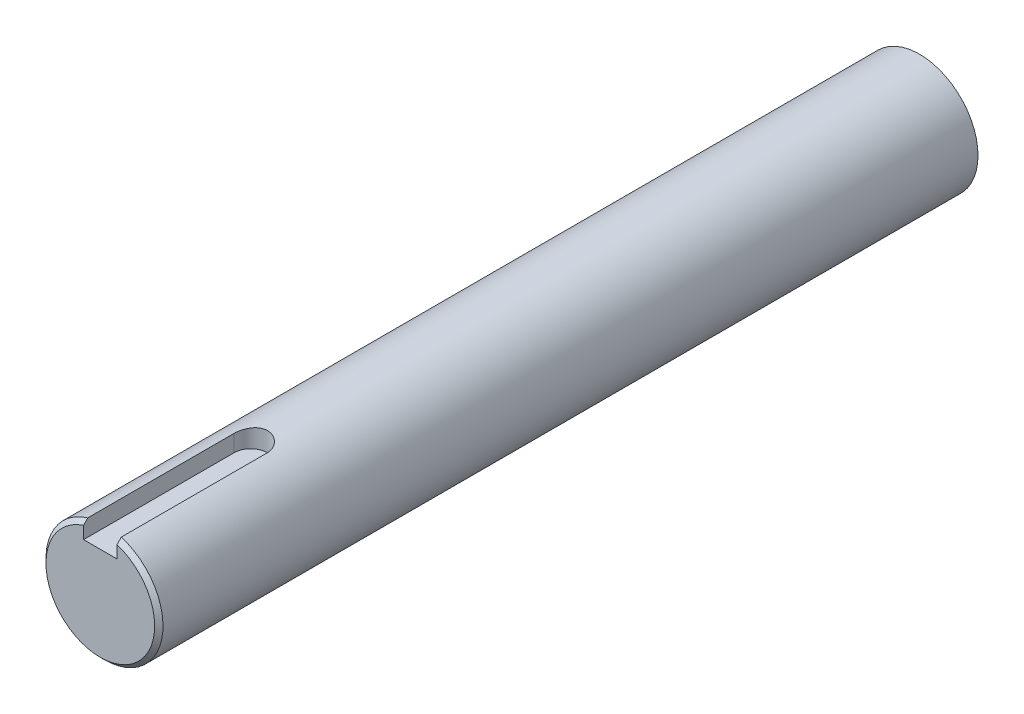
ISO-10303-21;
HEADER;
FILE_DESCRIPTION(('STEP AP214'),'2;1');
FILE_NAME('part.step','',(''),(''),'','','');
FILE_SCHEMA(('AUTOMOTIVE_DESIGN { 1 0 10303 214 1 1 1 1 }'));
ENDSEC;
DATA;
#1=APPLICATION_CONTEXT('core data for automotive mechanical design processes');
#2=APPLICATION_PROTOCOL_DEFINITION('international standard','automotive_design',2000,#1);
#3=PRODUCT_CONTEXT('',#1,'mechanical');
#4=PRODUCT('Part','Part','',(#3));
#5=PRODUCT_RELATED_PRODUCT_CATEGORY('part','',(#4));
#6=PRODUCT_DEFINITION_FORMATION('','',#4);
#7=PRODUCT_DEFINITION_CONTEXT('part definition',#1,'design');
#8=PRODUCT_DEFINITION('design','',#6,#7);
#9=PRODUCT_DEFINITION_SHAPE('','',#8);
#10=(LENGTH_UNIT() NAMED_UNIT(*) SI_UNIT(.MILLI.,.METRE.));
#11=(NAMED_UNIT(*) PLANE_ANGLE_UNIT() SI_UNIT($,.RADIAN.));
#12=(NAMED_UNIT(*) SI_UNIT($,.STERADIAN.) SOLID_ANGLE_UNIT());
#13=UNCERTAINTY_MEASURE_WITH_UNIT(LENGTH_MEASURE(1.E-05),#10,'distance_accuracy_value','');
#14=(GEOMETRIC_REPRESENTATION_CONTEXT(3) GLOBAL_UNCERTAINTY_ASSIGNED_CONTEXT((#13)) GLOBAL_UNIT_ASSIGNED_CONTEXT((#10,
#11,#12)) REPRESENTATION_CONTEXT('',''));
#15=CARTESIAN_POINT('',(0.,0.,0.));
#16=DIRECTION('',(0.,0.,1.));
#17=DIRECTION('',(1.,0.,0.));
#18=AXIS2_PLACEMENT_3D('',#15,#16,#17);
#19=CARTESIAN_POINT('',(0.,0.,98.));
#20=DIRECTION('',(0.,0.,-1.));
#21=DIRECTION('',(-1.,0.,0.));
#22=AXIS2_PLACEMENT_3D('',#19,#20,#21);
#23=CYLINDRICAL_SURFACE('',#22,7.);
#24=CARTESIAN_POINT('',(0.,0.,0.));
#25=DIRECTION('',(0.,0.,1.));
#26=DIRECTION('',(1.,0.,0.));
#27=AXIS2_PLACEMENT_3D('',#24,#25,#26);
#28=CIRCLE('',#27,7.);
#29=CARTESIAN_POINT('',(7.,0.,0.));
#30=VERTEX_POINT('',#29);
#31=EDGE_CURVE('E103',#30,#30,#28,.T.);
#32=ORIENTED_EDGE('',*,*,#31,.T.);
#33=EDGE_LOOP('',(#32));
#34=FACE_BOUND('',#33,.T.);
#35=DIRECTION('',(0.,0.,-1.));
#36=VECTOR('',#35,1.);
#37=CARTESIAN_POINT('',(2.,6.70820393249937,98.));
#38=LINE('',#37,#36);
#39=CARTESIAN_POINT('',(2.,6.70820393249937,97.5));
#40=VERTEX_POINT('',#39);
#41=CARTESIAN_POINT('',(2.,6.70820393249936,80.));
#42=VERTEX_POINT('',#41);
#43=EDGE_CURVE('E102',#40,#42,#38,.T.);
#44=ORIENTED_EDGE('',*,*,#43,.F.);
#45=CARTESIAN_POINT('',(0.,0.,97.5));
#46=DIRECTION('',(0.,0.,1.));
#47=DIRECTION('',(1.,0.,0.));
#48=AXIS2_PLACEMENT_3D('',#45,#46,#47);
#49=CIRCLE('',#48,7.);
#50=CARTESIAN_POINT('',(-2.,6.70820393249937,97.5));
#51=VERTEX_POINT('',#50);
#52=EDGE_CURVE('E48',#40,#51,#49,.F.);
#53=ORIENTED_EDGE('',*,*,#52,.T.);
#54=DIRECTION('',(0.,0.,-1.));
#55=VECTOR('',#54,1.);
#56=CARTESIAN_POINT('',(-2.,6.70820393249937,98.));
#57=LINE('',#56,#55);
#58=CARTESIAN_POINT('',(-2.,6.70820393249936,80.));
#59=VERTEX_POINT('',#58);
#60=EDGE_CURVE('E113',#51,#59,#57,.T.);
#61=ORIENTED_EDGE('',*,*,#60,.T.);
#62=CARTESIAN_POINT('',(2.,6.70820393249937,80.));
#63=CARTESIAN_POINT('',(2.00000099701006,6.70819953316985,79.9449659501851));
#64=CARTESIAN_POINT('',(1.99772698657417,6.70888204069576,79.8899594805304));
#65=CARTESIAN_POINT('',(1.988664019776,6.71157572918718,79.7803637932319));
#66=CARTESIAN_POINT('',(1.98187599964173,6.71358663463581,79.7257744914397));
#67=CARTESIAN_POINT('',(1.95485062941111,6.72152750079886,79.563492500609));
#68=CARTESIAN_POINT('',(1.92795143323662,6.72936619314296,79.4569243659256));
#69=CARTESIAN_POINT('',(1.85729763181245,6.74920530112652,79.2500599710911));
#70=CARTESIAN_POINT('',(1.81354760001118,6.76120458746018,79.1497620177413));
#71=CARTESIAN_POINT('',(1.7105009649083,6.78800504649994,78.9578633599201));
#72=CARTESIAN_POINT('',(1.65119805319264,6.80280735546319,78.8662662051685));
#73=CARTESIAN_POINT('',(1.51692637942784,6.83401742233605,78.6918092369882));
#74=CARTESIAN_POINT('',(1.44159286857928,6.85045675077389,78.6092358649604));
#75=CARTESIAN_POINT('',(1.27817556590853,6.88281888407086,78.4577009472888));
#76=CARTESIAN_POINT('',(1.19008966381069,6.89874160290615,78.3887416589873));
#77=CARTESIAN_POINT('',(1.00164390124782,6.92863365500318,78.2651698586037));
#78=CARTESIAN_POINT('',(0.901086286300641,6.94256116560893,78.210847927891));
#79=CARTESIAN_POINT('',(0.69180361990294,6.96652585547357,78.1199966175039));
#80=CARTESIAN_POINT('',(0.583080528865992,6.9765639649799,78.0834629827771));
#81=CARTESIAN_POINT('',(0.363559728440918,6.99139511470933,78.0301658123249));
#82=CARTESIAN_POINT('',(0.252890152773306,6.9963181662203,78.0129113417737));
#83=CARTESIAN_POINT('',(0.0301224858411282,7.0008209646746,77.9971132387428));
#84=CARTESIAN_POINT('',(-0.0819753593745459,7.00040161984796,77.9985664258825));
#85=CARTESIAN_POINT('',(-0.300980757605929,6.99436005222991,78.0198064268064));
#86=CARTESIAN_POINT('',(-0.40794465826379,6.98888865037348,78.0390618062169));
#87=CARTESIAN_POINT('',(-0.617053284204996,6.97353876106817,78.0944954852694));
#88=CARTESIAN_POINT('',(-0.719197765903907,6.96366005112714,78.1306746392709));
#89=CARTESIAN_POINT('',(-0.917074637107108,6.94039022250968,78.2193097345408));
#90=CARTESIAN_POINT('',(-1.01272458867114,6.92696183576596,78.2719395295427));
#91=CARTESIAN_POINT('',(-1.19400864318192,6.89802743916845,78.3918457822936));
#92=CARTESIAN_POINT('',(-1.27964070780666,6.88252100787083,78.4591252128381));
#93=CARTESIAN_POINT('',(-1.4416242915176,6.85045847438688,78.6091975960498));
#94=CARTESIAN_POINT('',(-1.51754611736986,6.83388462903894,78.6924510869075));
#95=CARTESIAN_POINT('',(-1.65448071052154,6.8020328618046,78.8706972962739));
#96=CARTESIAN_POINT('',(-1.71548924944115,6.78675530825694,78.9656933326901));
#97=CARTESIAN_POINT('',(-1.82126577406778,6.75914312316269,79.165787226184));
#98=CARTESIAN_POINT('',(-1.86589126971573,6.74683461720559,79.2709641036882));
#99=CARTESIAN_POINT('',(-1.93662306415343,6.72687625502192,79.4877120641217));
#100=CARTESIAN_POINT('',(-1.96275743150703,6.71921934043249,79.5992731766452));
#101=CARTESIAN_POINT('',(-1.98612021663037,6.71232934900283,79.7598794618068));
#102=CARTESIAN_POINT('',(-1.99132502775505,6.71078540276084,79.807779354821));
#103=CARTESIAN_POINT('',(-1.99826154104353,6.7087227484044,79.9037782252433));
#104=CARTESIAN_POINT('',(-1.99999854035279,6.70820247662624,79.9518767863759));
#105=CARTESIAN_POINT('',(-2.,6.70820393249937,80.));
#106=B_SPLINE_CURVE_WITH_KNOTS('',3,(#62,#63,#64,#65,#66,#67,#68,#69,#70,#71,#72,#73,#74,#75,
#76,#77,#78,#79,#80,#81,#82,#83,#84,#85,#86,#87,#88,#89,#90,#91,#92,#93,#94,#95,#96,#97,#98,#99,
#100,#101,#102,#103,#104,#105),.UNSPECIFIED.,.F.,.F.,(4,2,2,2,2,2,2,2,2,2,2,2,2,2,2,2,2,2,2,2,2,
4),(0.,0.164996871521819,0.32995953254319,0.658815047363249,0.987581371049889,1.3164812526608,
1.65386790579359,1.99131045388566,2.33502692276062,2.67866113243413,3.01332990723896,
3.34794178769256,3.67287650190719,3.99782762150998,4.32633613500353,4.65491137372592,
4.99498620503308,5.33515734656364,5.67822068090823,6.0207621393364,6.16526974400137,
6.30955644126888),.UNSPECIFIED.);
#107=EDGE_CURVE('E97',#42,#59,#106,.T.);
#108=ORIENTED_EDGE('',*,*,#107,.F.);
#109=EDGE_LOOP('',(#44,#53,#61,#108));
#110=FACE_BOUND('',#109,.T.);
#111=ADVANCED_FACE('F35',(#34,#110),#23,.T.);
#112=CARTESIAN_POINT('',(2.,4.7,98.));
#113=DIRECTION('',(1.,0.,0.));
#114=DIRECTION('',(0.,1.,0.));
#115=AXIS2_PLACEMENT_3D('',#112,#113,#114);
#116=PLANE('',#115);
#117=DIRECTION('',(0.,-1.,0.));
#118=VECTOR('',#117,1.);
#119=CARTESIAN_POINT('',(2.,4.7,98.));
#120=LINE('',#119,#118);
#121=CARTESIAN_POINT('',(2.,6.18465843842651,98.));
#122=VERTEX_POINT('',#121);
#123=CARTESIAN_POINT('',(2.,4.7,98.));
#124=VERTEX_POINT('',#123);
#125=EDGE_CURVE('E161',#122,#124,#120,.T.);
#126=ORIENTED_EDGE('',*,*,#125,.F.);
#127=CARTESIAN_POINT('',(2.,6.18465843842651,98.));
#128=CARTESIAN_POINT('',(2.,6.27206463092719,97.9168222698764));
#129=CARTESIAN_POINT('',(2.,6.35939651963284,97.8335667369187));
#130=CARTESIAN_POINT('',(2.,6.53391168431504,97.6669000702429));
#131=CARTESIAN_POINT('',(2.,6.62109496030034,97.583488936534));
#132=CARTESIAN_POINT('',(2.,6.70820393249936,97.5));
#133=B_SPLINE_CURVE_WITH_KNOTS('',3,(#127,#128,#129,#130,#131,#132),.UNSPECIFIED.,.F.,.F.,(4,2,
4),(0.,0.361973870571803,0.723947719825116),.UNSPECIFIED.);
#134=EDGE_CURVE('E62',#122,#40,#133,.T.);
#135=ORIENTED_EDGE('',*,*,#134,.T.);
#136=ORIENTED_EDGE('',*,*,#43,.T.);
#137=DIRECTION('',(0.,1.,0.));
#138=VECTOR('',#137,1.);
#139=CARTESIAN_POINT('',(2.,4.7,80.));
#140=LINE('',#139,#138);
#141=CARTESIAN_POINT('',(2.,4.7,80.));
#142=VERTEX_POINT('',#141);
#143=EDGE_CURVE('E89',#142,#42,#140,.T.);
#144=ORIENTED_EDGE('',*,*,#143,.F.);
#145=DIRECTION('',(0.,0.,-1.));
#146=VECTOR('',#145,1.);
#147=CARTESIAN_POINT('',(2.,4.7,98.));
#148=LINE('',#147,#146);
#149=EDGE_CURVE('E101',#124,#142,#148,.T.);
#150=ORIENTED_EDGE('',*,*,#149,.F.);
#151=EDGE_LOOP('',(#126,#135,#136,#144,#150));
#152=FACE_BOUND('',#151,.T.);
#153=ADVANCED_FACE('F100',(#152),#116,.F.);
#154=CARTESIAN_POINT('',(2.,4.7,98.));
#155=DIRECTION('',(0.,-1.,0.));
#156=DIRECTION('',(1.,0.,0.));
#157=AXIS2_PLACEMENT_3D('',#154,#155,#156);
#158=PLANE('',#157);
#159=ORIENTED_EDGE('',*,*,#149,.T.);
#160=CARTESIAN_POINT('',(0.,4.7,80.));
#161=DIRECTION('',(0.,1.,0.));
#162=DIRECTION('',(-1.,0.,0.));
#163=AXIS2_PLACEMENT_3D('',#160,#161,#162);
#164=CIRCLE('',#163,2.);
#165=CARTESIAN_POINT('',(-2.,4.7,80.));
#166=VERTEX_POINT('',#165);
#167=EDGE_CURVE('E85',#142,#166,#164,.T.);
#168=ORIENTED_EDGE('',*,*,#167,.T.);
#169=DIRECTION('',(0.,0.,-1.));
#170=VECTOR('',#169,1.);
#171=CARTESIAN_POINT('',(-2.,4.7,98.));
#172=LINE('',#171,#170);
#173=CARTESIAN_POINT('',(-2.,4.7,98.));
#174=VERTEX_POINT('',#173);
#175=EDGE_CURVE('E109',#174,#166,#172,.T.);
#176=ORIENTED_EDGE('',*,*,#175,.F.);
#177=DIRECTION('',(-1.,0.,0.));
#178=VECTOR('',#177,1.);
#179=CARTESIAN_POINT('',(2.,4.7,98.));
#180=LINE('',#179,#178);
#181=EDGE_CURVE('E107',#124,#174,#180,.T.);
#182=ORIENTED_EDGE('',*,*,#181,.F.);
#183=EDGE_LOOP('',(#159,#168,#176,#182));
#184=FACE_BOUND('',#183,.T.);
#185=ADVANCED_FACE('F106',(#184),#158,.F.);
#186=CARTESIAN_POINT('',(-2.,4.7,98.));
#187=DIRECTION('',(-1.,0.,0.));
#188=DIRECTION('',(0.,0.,1.));
#189=AXIS2_PLACEMENT_3D('',#186,#187,#188);
#190=PLANE('',#189);
#191=ORIENTED_EDGE('',*,*,#60,.F.);
#192=CARTESIAN_POINT('',(-2.,6.70820393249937,97.5));
#193=CARTESIAN_POINT('',(-2.,6.62109496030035,97.583488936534));
#194=CARTESIAN_POINT('',(-2.,6.53391168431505,97.6669000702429));
#195=CARTESIAN_POINT('',(-2.,6.35939651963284,97.8335667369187));
#196=CARTESIAN_POINT('',(-2.,6.27206463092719,97.9168222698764));
#197=CARTESIAN_POINT('',(-2.,6.18465843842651,98.));
#198=B_SPLINE_CURVE_WITH_KNOTS('',3,(#192,#193,#194,#195,#196,#197),.UNSPECIFIED.,.F.,.F.,(4,2,
4),(0.,0.361973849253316,0.723947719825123),.UNSPECIFIED.);
#199=CARTESIAN_POINT('',(-2.,6.18465843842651,98.));
#200=VERTEX_POINT('',#199);
#201=EDGE_CURVE('E11',#51,#200,#198,.T.);
#202=ORIENTED_EDGE('',*,*,#201,.T.);
#203=DIRECTION('',(0.,1.,0.));
#204=VECTOR('',#203,1.);
#205=CARTESIAN_POINT('',(-2.,4.7,98.));
#206=LINE('',#205,#204);
#207=EDGE_CURVE('E153',#174,#200,#206,.T.);
#208=ORIENTED_EDGE('',*,*,#207,.F.);
#209=ORIENTED_EDGE('',*,*,#175,.T.);
#210=DIRECTION('',(0.,-1.,0.));
#211=VECTOR('',#210,1.);
#212=CARTESIAN_POINT('',(-2.,4.7,80.));
#213=LINE('',#212,#211);
#214=EDGE_CURVE('E92',#59,#166,#213,.T.);
#215=ORIENTED_EDGE('',*,*,#214,.F.);
#216=EDGE_LOOP('',(#191,#202,#208,#209,#215));
#217=FACE_BOUND('',#216,.T.);
#218=ADVANCED_FACE('F124',(#217),#190,.F.);
#219=CARTESIAN_POINT('',(0.,0.,98.));
#220=DIRECTION('',(0.,0.,1.));
#221=DIRECTION('',(1.,0.,0.));
#222=AXIS2_PLACEMENT_3D('',#219,#220,#221);
#223=PLANE('',#222);
#224=ORIENTED_EDGE('',*,*,#207,.T.);
#225=CARTESIAN_POINT('',(0.,0.,98.));
#226=DIRECTION('',(0.,0.,1.));
#227=DIRECTION('',(1.,0.,0.));
#228=AXIS2_PLACEMENT_3D('',#225,#226,#227);
#229=CIRCLE('',#228,6.50000000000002);
#230=EDGE_CURVE('E108',#200,#122,#229,.T.);
#231=ORIENTED_EDGE('',*,*,#230,.T.);
#232=ORIENTED_EDGE('',*,*,#125,.T.);
#233=ORIENTED_EDGE('',*,*,#181,.T.);
#234=EDGE_LOOP('',(#224,#231,#232,#233));
#235=FACE_BOUND('',#234,.T.);
#236=ADVANCED_FACE('F128',(#235),#223,.T.);
#237=CARTESIAN_POINT('',(0.,0.,0.));
#238=DIRECTION('',(0.,0.,1.));
#239=DIRECTION('',(1.,0.,0.));
#240=AXIS2_PLACEMENT_3D('',#237,#238,#239);
#241=PLANE('',#240);
#242=ORIENTED_EDGE('',*,*,#31,.F.);
#243=EDGE_LOOP('',(#242));
#244=FACE_BOUND('',#243,.T.);
#245=ADVANCED_FACE('F134',(#244),#241,.F.);
#246=CARTESIAN_POINT('',(0.,84.7,80.));
#247=DIRECTION('',(0.,-1.,0.));
#248=DIRECTION('',(1.,0.,0.));
#249=AXIS2_PLACEMENT_3D('',#246,#247,#248);
#250=CYLINDRICAL_SURFACE('',#249,2.);
#251=ORIENTED_EDGE('',*,*,#107,.T.);
#252=ORIENTED_EDGE('',*,*,#214,.T.);
#253=ORIENTED_EDGE('',*,*,#167,.F.);
#254=ORIENTED_EDGE('',*,*,#143,.T.);
#255=EDGE_LOOP('',(#251,#252,#253,#254));
#256=FACE_BOUND('',#255,.T.);
#257=ADVANCED_FACE('F88',(#256),#250,.F.);
#258=CARTESIAN_POINT('',(0.,0.,98.));
#259=DIRECTION('',(0.,0.,-1.));
#260=DIRECTION('',(-1.,0.,0.));
#261=AXIS2_PLACEMENT_3D('',#258,#259,#260);
#262=CONICAL_SURFACE('',#261,6.50000000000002,0.785398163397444);
#263=ORIENTED_EDGE('',*,*,#201,.F.);
#264=ORIENTED_EDGE('',*,*,#52,.F.);
#265=ORIENTED_EDGE('',*,*,#134,.F.);
#266=ORIENTED_EDGE('',*,*,#230,.F.);
#267=EDGE_LOOP('',(#263,#264,#265,#266));
#268=FACE_BOUND('',#267,.T.);
#269=ADVANCED_FACE('F37',(#268),#262,.T.);
#270=CLOSED_SHELL('',(#111,#153,#185,#218,#236,#245,#257,#269));
#271=MANIFOLD_SOLID_BREP('B2',#270);
#272=ADVANCED_BREP_SHAPE_REPRESENTATION('',(#18,#271),#14);
#273=SHAPE_DEFINITION_REPRESENTATION(#9,#272);
ENDSEC;
END-ISO-10303-21;
